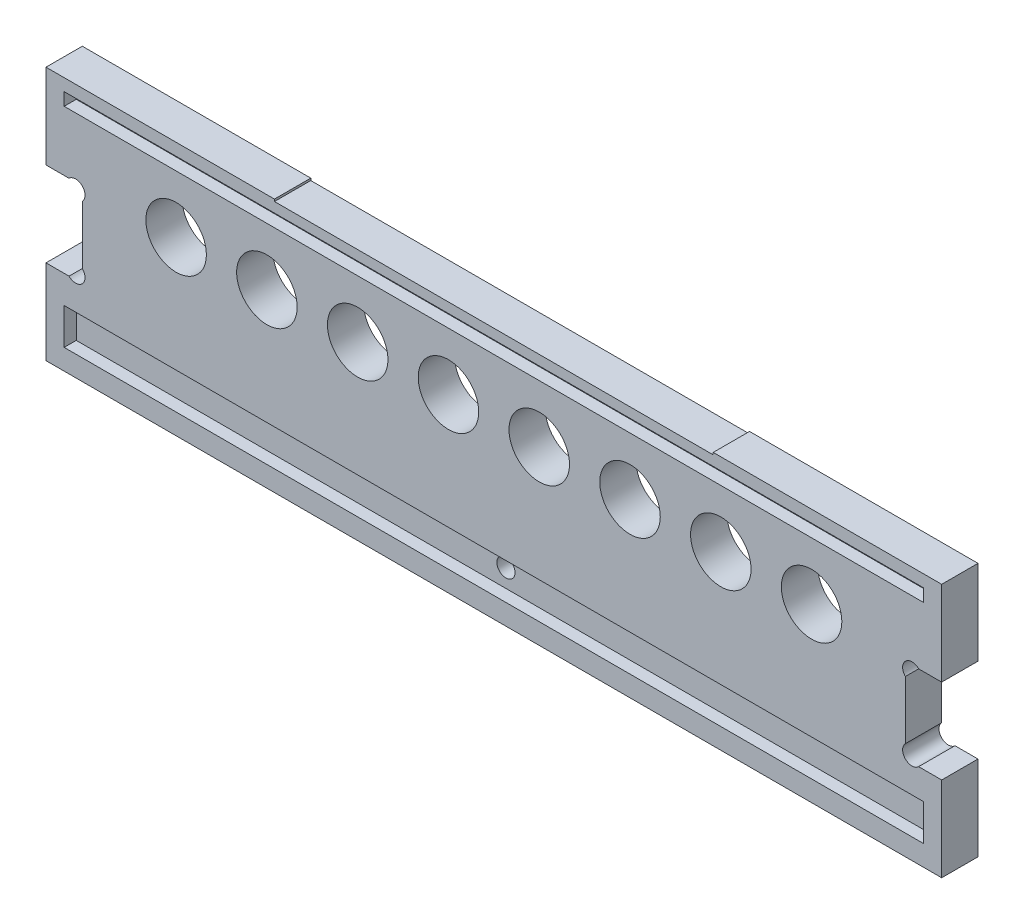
from build123d import *

# Parameters (mm, degrees)
ESQUISSE1_R             = 1.5
ESQUISSE1_R_2           = 5
EXTRUSION1_DEPTH        = 6
ESQUISSE2_W             = 142
ESQUISSE2_H             = 2.10000947
ESQUISSE2_H_2           = 6
ENL_V_MAT_EXTRU_1_DEPTH = 2


with BuildPart() as part:
    # Esquisse1 → Extrusion1 (new body)
    with BuildSketch(Plane.XY):
        with BuildLine():
            Line((0, 42), (37.75, 42))
            Line((37.75, 42), (37.75, 41.65))
            Line((37.75, 41.65), (110.25, 41.65))
            Line((110.25, 41.65), (110.25, 42))
            Line((110.25, 42), (148, 42))
            Line((148, 42), (148, 28))
            Line((148, 28), (144.192031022, 28))
            ThreePointArc((144.192031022, 28), (142, 28), (142, 25.807968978))
            Line((142, 25.807968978), (142, 16.192031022))
            ThreePointArc((142, 16.192031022), (142, 14), (144.192031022, 14))
            Line((144.192031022, 14), (148, 14))
            Line((148, 14), (148, 0))
            Line((148, 0), (0, 0))
            Line((0, 0), (0, 14))
            Line((0, 14), (3.807968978, 14))
            ThreePointArc((3.807968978, 14), (6, 14), (6, 16.192031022))
            Line((6, 16.192031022), (6, 25.807968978))
            ThreePointArc((6, 25.807968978), (6, 28), (3.807968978, 28))
            Line((3.807968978, 28), (0, 28))
            Line((0, 28), (0, 42))
        make_face()
        with Locations((74, 6.397626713)):
            Circle(ESQUISSE1_R, mode=Mode.SUBTRACT)
        with Locations((21.5, 28.4)):
            Circle(ESQUISSE1_R_2, mode=Mode.SUBTRACT)
        with Locations((36.5, 28.4)):
            Circle(ESQUISSE1_R_2, mode=Mode.SUBTRACT)
        with Locations((51.5, 28.4)):
            Circle(ESQUISSE1_R_2, mode=Mode.SUBTRACT)
        with Locations((66.5, 28.4)):
            Circle(ESQUISSE1_R_2, mode=Mode.SUBTRACT)
        with Locations((81.5, 28.4)):
            Circle(ESQUISSE1_R_2, mode=Mode.SUBTRACT)
        with Locations((96.5, 28.4)):
            Circle(ESQUISSE1_R_2, mode=Mode.SUBTRACT)
        with Locations((111.5, 28.4)):
            Circle(ESQUISSE1_R_2, mode=Mode.SUBTRACT)
        with Locations((126.5, 28.4)):
            Circle(ESQUISSE1_R_2, mode=Mode.SUBTRACT)
    extrude(amount=EXTRUSION1_DEPTH)

    # Esquisse2 → Enl_v. mat.-Extru.1 (cut)
    with BuildSketch(Plane.XY.offset(6)):
        with Locations((74, 38.949995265)):
            Rectangle(ESQUISSE2_W, ESQUISSE2_H)
        with Locations((74, 6.4)):
            Rectangle(ESQUISSE2_W, ESQUISSE2_H_2)
    extrude(amount=-ENL_V_MAT_EXTRU_1_DEPTH, mode=Mode.SUBTRACT)


solid = part.part
